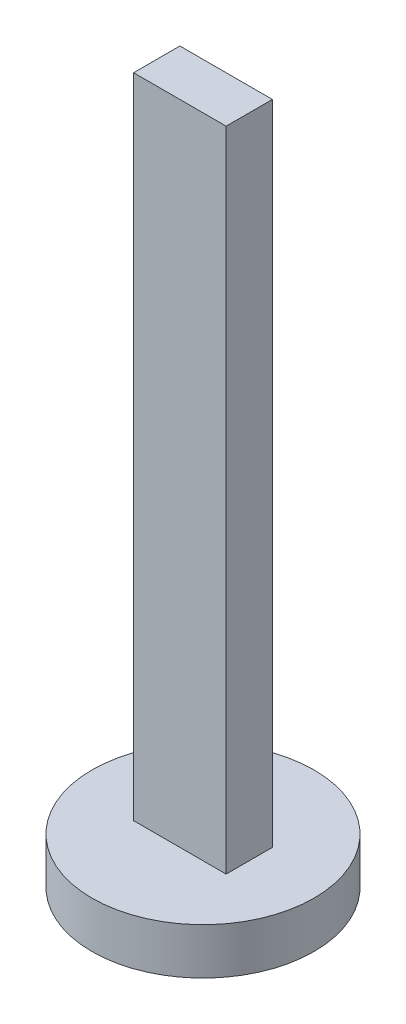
ISO-10303-21;
HEADER;
FILE_DESCRIPTION(('STEP AP214'),'2;1');
FILE_NAME('part.step','',(''),(''),'','','');
FILE_SCHEMA(('AUTOMOTIVE_DESIGN { 1 0 10303 214 1 1 1 1 }'));
ENDSEC;
DATA;
#1=APPLICATION_CONTEXT('core data for automotive mechanical design processes');
#2=APPLICATION_PROTOCOL_DEFINITION('international standard','automotive_design',2000,#1);
#3=PRODUCT_CONTEXT('',#1,'mechanical');
#4=PRODUCT('Part','Part','',(#3));
#5=PRODUCT_RELATED_PRODUCT_CATEGORY('part','',(#4));
#6=PRODUCT_DEFINITION_FORMATION('','',#4);
#7=PRODUCT_DEFINITION_CONTEXT('part definition',#1,'design');
#8=PRODUCT_DEFINITION('design','',#6,#7);
#9=PRODUCT_DEFINITION_SHAPE('','',#8);
#10=(LENGTH_UNIT() NAMED_UNIT(*) SI_UNIT(.MILLI.,.METRE.));
#11=(NAMED_UNIT(*) PLANE_ANGLE_UNIT() SI_UNIT($,.RADIAN.));
#12=(NAMED_UNIT(*) SI_UNIT($,.STERADIAN.) SOLID_ANGLE_UNIT());
#13=UNCERTAINTY_MEASURE_WITH_UNIT(LENGTH_MEASURE(1.E-05),#10,'distance_accuracy_value','');
#14=(GEOMETRIC_REPRESENTATION_CONTEXT(3) GLOBAL_UNCERTAINTY_ASSIGNED_CONTEXT((#13)) GLOBAL_UNIT_ASSIGNED_CONTEXT((#10,
#11,#12)) REPRESENTATION_CONTEXT('',''));
#15=CARTESIAN_POINT('',(0.,0.,0.));
#16=DIRECTION('',(0.,0.,1.));
#17=DIRECTION('',(1.,0.,0.));
#18=AXIS2_PLACEMENT_3D('',#15,#16,#17);
#19=CARTESIAN_POINT('',(0.,5.,0.));
#20=DIRECTION('',(0.,-1.,0.));
#21=DIRECTION('',(0.,0.,-1.));
#22=AXIS2_PLACEMENT_3D('',#19,#20,#21);
#23=CYLINDRICAL_SURFACE('',#22,12.);
#24=CARTESIAN_POINT('',(0.,5.,0.));
#25=DIRECTION('',(0.,1.,0.));
#26=DIRECTION('',(0.,0.,1.));
#27=AXIS2_PLACEMENT_3D('',#24,#25,#26);
#28=CIRCLE('',#27,12.);
#29=CARTESIAN_POINT('',(0.,5.,12.));
#30=VERTEX_POINT('',#29);
#31=EDGE_CURVE('E11',#30,#30,#28,.T.);
#32=ORIENTED_EDGE('',*,*,#31,.F.);
#33=EDGE_LOOP('',(#32));
#34=FACE_BOUND('',#33,.T.);
#35=CARTESIAN_POINT('',(0.,0.,0.));
#36=DIRECTION('',(0.,1.,0.));
#37=DIRECTION('',(0.,0.,1.));
#38=AXIS2_PLACEMENT_3D('',#35,#36,#37);
#39=CIRCLE('',#38,12.);
#40=CARTESIAN_POINT('',(0.,0.,12.));
#41=VERTEX_POINT('',#40);
#42=EDGE_CURVE('E48',#41,#41,#39,.T.);
#43=ORIENTED_EDGE('',*,*,#42,.T.);
#44=EDGE_LOOP('',(#43));
#45=FACE_BOUND('',#44,.T.);
#46=ADVANCED_FACE('F45',(#34,#45),#23,.T.);
#47=CARTESIAN_POINT('',(0.,5.,0.));
#48=DIRECTION('',(0.,1.,0.));
#49=DIRECTION('',(0.,0.,1.));
#50=AXIS2_PLACEMENT_3D('',#47,#48,#49);
#51=PLANE('',#50);
#52=DIRECTION('',(0.,0.,-1.));
#53=VECTOR('',#52,1.);
#54=CARTESIAN_POINT('',(5.,5.,-2.5));
#55=LINE('',#54,#53);
#56=CARTESIAN_POINT('',(5.,5.,2.5));
#57=VERTEX_POINT('',#56);
#58=CARTESIAN_POINT('',(5.,5.,-2.5));
#59=VERTEX_POINT('',#58);
#60=EDGE_CURVE('E60',#57,#59,#55,.T.);
#61=ORIENTED_EDGE('',*,*,#60,.F.);
#62=DIRECTION('',(1.,0.,0.));
#63=VECTOR('',#62,1.);
#64=CARTESIAN_POINT('',(-5.,5.,2.5));
#65=LINE('',#64,#63);
#66=CARTESIAN_POINT('',(-5.,5.,2.5));
#67=VERTEX_POINT('',#66);
#68=EDGE_CURVE('E64',#67,#57,#65,.T.);
#69=ORIENTED_EDGE('',*,*,#68,.F.);
#70=DIRECTION('',(0.,0.,1.));
#71=VECTOR('',#70,1.);
#72=CARTESIAN_POINT('',(-5.,5.,-2.5));
#73=LINE('',#72,#71);
#74=CARTESIAN_POINT('',(-5.,5.,-2.5));
#75=VERTEX_POINT('',#74);
#76=EDGE_CURVE('E225',#75,#67,#73,.T.);
#77=ORIENTED_EDGE('',*,*,#76,.F.);
#78=DIRECTION('',(-1.,0.,0.));
#79=VECTOR('',#78,1.);
#80=CARTESIAN_POINT('',(-5.,5.,-2.5));
#81=LINE('',#80,#79);
#82=EDGE_CURVE('E235',#59,#75,#81,.T.);
#83=ORIENTED_EDGE('',*,*,#82,.F.);
#84=EDGE_LOOP('',(#61,#69,#77,#83));
#85=FACE_BOUND('',#84,.T.);
#86=ORIENTED_EDGE('',*,*,#31,.T.);
#87=EDGE_LOOP('',(#86));
#88=FACE_BOUND('',#87,.T.);
#89=ADVANCED_FACE('F132',(#85,#88),#51,.T.);
#90=CARTESIAN_POINT('',(0.,0.,0.));
#91=DIRECTION('',(0.,1.,0.));
#92=DIRECTION('',(0.,0.,1.));
#93=AXIS2_PLACEMENT_3D('',#90,#91,#92);
#94=PLANE('',#93);
#95=CARTESIAN_POINT('',(0.,0.,0.));
#96=DIRECTION('',(0.,-1.,0.));
#97=DIRECTION('',(0.,0.,-1.));
#98=AXIS2_PLACEMENT_3D('',#95,#96,#97);
#99=CIRCLE('',#98,10.5);
#100=CARTESIAN_POINT('',(0.,0.,-10.5));
#101=VERTEX_POINT('',#100);
#102=EDGE_CURVE('E109',#101,#101,#99,.T.);
#103=ORIENTED_EDGE('',*,*,#102,.F.);
#104=EDGE_LOOP('',(#103));
#105=FACE_BOUND('',#104,.T.);
#106=ORIENTED_EDGE('',*,*,#42,.F.);
#107=EDGE_LOOP('',(#106));
#108=FACE_BOUND('',#107,.T.);
#109=ADVANCED_FACE('F129',(#105,#108),#94,.F.);
#110=CARTESIAN_POINT('',(0.,2.5,0.));
#111=DIRECTION('',(0.,-1.,0.));
#112=DIRECTION('',(0.,0.,-1.));
#113=AXIS2_PLACEMENT_3D('',#110,#111,#112);
#114=CYLINDRICAL_SURFACE('',#113,10.5);
#115=CARTESIAN_POINT('',(0.,2.5,0.));
#116=DIRECTION('',(0.,-1.,0.));
#117=DIRECTION('',(0.,0.,-1.));
#118=AXIS2_PLACEMENT_3D('',#115,#116,#117);
#119=CIRCLE('',#118,10.5);
#120=CARTESIAN_POINT('',(0.,2.5,-10.5));
#121=VERTEX_POINT('',#120);
#122=EDGE_CURVE('E114',#121,#121,#119,.T.);
#123=ORIENTED_EDGE('',*,*,#122,.F.);
#124=EDGE_LOOP('',(#123));
#125=FACE_BOUND('',#124,.T.);
#126=ORIENTED_EDGE('',*,*,#102,.T.);
#127=EDGE_LOOP('',(#126));
#128=FACE_BOUND('',#127,.T.);
#129=ADVANCED_FACE('F131',(#125,#128),#114,.F.);
#130=CARTESIAN_POINT('',(0.,2.5,0.));
#131=DIRECTION('',(0.,-1.,0.));
#132=DIRECTION('',(0.,0.,-1.));
#133=AXIS2_PLACEMENT_3D('',#130,#131,#132);
#134=PLANE('',#133);
#135=ORIENTED_EDGE('',*,*,#122,.T.);
#136=EDGE_LOOP('',(#135));
#137=FACE_BOUND('',#136,.T.);
#138=ADVANCED_FACE('F138',(#137),#134,.T.);
#139=CARTESIAN_POINT('',(5.,75.,-2.5));
#140=DIRECTION('',(-1.,0.,0.));
#141=DIRECTION('',(0.,0.,1.));
#142=AXIS2_PLACEMENT_3D('',#139,#140,#141);
#143=PLANE('',#142);
#144=ORIENTED_EDGE('',*,*,#60,.T.);
#145=DIRECTION('',(0.,-1.,0.));
#146=VECTOR('',#145,1.);
#147=CARTESIAN_POINT('',(5.,75.,-2.5));
#148=LINE('',#147,#146);
#149=CARTESIAN_POINT('',(5.,75.,-2.5));
#150=VERTEX_POINT('',#149);
#151=EDGE_CURVE('E89',#150,#59,#148,.T.);
#152=ORIENTED_EDGE('',*,*,#151,.F.);
#153=DIRECTION('',(0.,0.,-1.));
#154=VECTOR('',#153,1.);
#155=CARTESIAN_POINT('',(5.,75.,-2.5));
#156=LINE('',#155,#154);
#157=CARTESIAN_POINT('',(5.,75.,2.5));
#158=VERTEX_POINT('',#157);
#159=EDGE_CURVE('E96',#158,#150,#156,.T.);
#160=ORIENTED_EDGE('',*,*,#159,.F.);
#161=DIRECTION('',(0.,-1.,0.));
#162=VECTOR('',#161,1.);
#163=CARTESIAN_POINT('',(5.,75.,2.5));
#164=LINE('',#163,#162);
#165=EDGE_CURVE('E222',#158,#57,#164,.T.);
#166=ORIENTED_EDGE('',*,*,#165,.T.);
#167=EDGE_LOOP('',(#144,#152,#160,#166));
#168=FACE_BOUND('',#167,.T.);
#169=ADVANCED_FACE('F107',(#168),#143,.F.);
#170=CARTESIAN_POINT('',(-5.,75.,-2.5));
#171=DIRECTION('',(0.,0.,1.));
#172=DIRECTION('',(1.,0.,0.));
#173=AXIS2_PLACEMENT_3D('',#170,#171,#172);
#174=PLANE('',#173);
#175=ORIENTED_EDGE('',*,*,#82,.T.);
#176=DIRECTION('',(0.,-1.,0.));
#177=VECTOR('',#176,1.);
#178=CARTESIAN_POINT('',(-5.,75.,-2.5));
#179=LINE('',#178,#177);
#180=CARTESIAN_POINT('',(-5.,75.,-2.5));
#181=VERTEX_POINT('',#180);
#182=EDGE_CURVE('E91',#181,#75,#179,.T.);
#183=ORIENTED_EDGE('',*,*,#182,.F.);
#184=DIRECTION('',(-1.,0.,0.));
#185=VECTOR('',#184,1.);
#186=CARTESIAN_POINT('',(-5.,75.,-2.5));
#187=LINE('',#186,#185);
#188=EDGE_CURVE('E84',#150,#181,#187,.T.);
#189=ORIENTED_EDGE('',*,*,#188,.F.);
#190=ORIENTED_EDGE('',*,*,#151,.T.);
#191=EDGE_LOOP('',(#175,#183,#189,#190));
#192=FACE_BOUND('',#191,.T.);
#193=ADVANCED_FACE('F87',(#192),#174,.F.);
#194=CARTESIAN_POINT('',(-5.,75.,-2.5));
#195=DIRECTION('',(1.,0.,0.));
#196=DIRECTION('',(0.,0.,-1.));
#197=AXIS2_PLACEMENT_3D('',#194,#195,#196);
#198=PLANE('',#197);
#199=ORIENTED_EDGE('',*,*,#76,.T.);
#200=DIRECTION('',(0.,-1.,0.));
#201=VECTOR('',#200,1.);
#202=CARTESIAN_POINT('',(-5.,75.,2.5));
#203=LINE('',#202,#201);
#204=CARTESIAN_POINT('',(-5.,75.,2.5));
#205=VERTEX_POINT('',#204);
#206=EDGE_CURVE('E116',#205,#67,#203,.T.);
#207=ORIENTED_EDGE('',*,*,#206,.F.);
#208=DIRECTION('',(0.,0.,1.));
#209=VECTOR('',#208,1.);
#210=CARTESIAN_POINT('',(-5.,75.,-2.5));
#211=LINE('',#210,#209);
#212=EDGE_CURVE('E95',#181,#205,#211,.T.);
#213=ORIENTED_EDGE('',*,*,#212,.F.);
#214=ORIENTED_EDGE('',*,*,#182,.T.);
#215=EDGE_LOOP('',(#199,#207,#213,#214));
#216=FACE_BOUND('',#215,.T.);
#217=ADVANCED_FACE('F191',(#216),#198,.F.);
#218=CARTESIAN_POINT('',(-5.,75.,2.5));
#219=DIRECTION('',(0.,0.,-1.));
#220=DIRECTION('',(-1.,0.,0.));
#221=AXIS2_PLACEMENT_3D('',#218,#219,#220);
#222=PLANE('',#221);
#223=ORIENTED_EDGE('',*,*,#68,.T.);
#224=ORIENTED_EDGE('',*,*,#165,.F.);
#225=DIRECTION('',(1.,0.,0.));
#226=VECTOR('',#225,1.);
#227=CARTESIAN_POINT('',(-5.,75.,2.5));
#228=LINE('',#227,#226);
#229=EDGE_CURVE('E101',#205,#158,#228,.T.);
#230=ORIENTED_EDGE('',*,*,#229,.F.);
#231=ORIENTED_EDGE('',*,*,#206,.T.);
#232=EDGE_LOOP('',(#223,#224,#230,#231));
#233=FACE_BOUND('',#232,.T.);
#234=ADVANCED_FACE('F200',(#233),#222,.F.);
#235=CARTESIAN_POINT('',(0.,75.,0.));
#236=DIRECTION('',(0.,1.,0.));
#237=DIRECTION('',(0.,0.,1.));
#238=AXIS2_PLACEMENT_3D('',#235,#236,#237);
#239=PLANE('',#238);
#240=ORIENTED_EDGE('',*,*,#159,.T.);
#241=ORIENTED_EDGE('',*,*,#188,.T.);
#242=ORIENTED_EDGE('',*,*,#212,.T.);
#243=ORIENTED_EDGE('',*,*,#229,.T.);
#244=EDGE_LOOP('',(#240,#241,#242,#243));
#245=FACE_BOUND('',#244,.T.);
#246=ADVANCED_FACE('F99',(#245),#239,.T.);
#247=CLOSED_SHELL('',(#46,#89,#109,#129,#138,#169,#193,#217,#234,#246));
#248=MANIFOLD_SOLID_BREP('B2',#247);
#249=ADVANCED_BREP_SHAPE_REPRESENTATION('',(#18,#248),#14);
#250=SHAPE_DEFINITION_REPRESENTATION(#9,#249);
ENDSEC;
END-ISO-10303-21;
